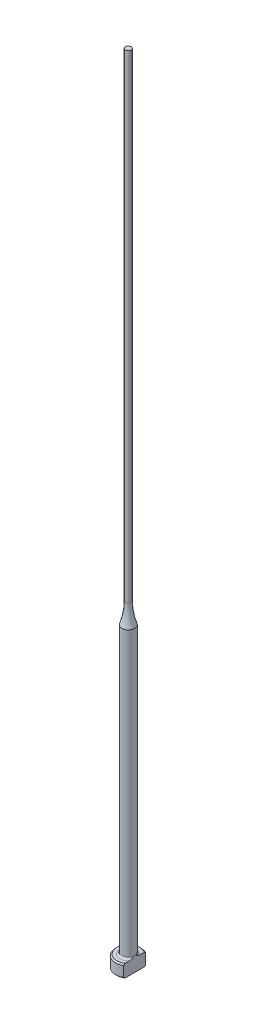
ISO-10303-21;
HEADER;
FILE_DESCRIPTION(('STEP AP214'),'2;1');
FILE_NAME('part.step','',(''),(''),'','','');
FILE_SCHEMA(('AUTOMOTIVE_DESIGN { 1 0 10303 214 1 1 1 1 }'));
ENDSEC;
DATA;
#1=APPLICATION_CONTEXT('core data for automotive mechanical design processes');
#2=APPLICATION_PROTOCOL_DEFINITION('international standard','automotive_design',2000,#1);
#3=PRODUCT_CONTEXT('',#1,'mechanical');
#4=PRODUCT('Part','Part','',(#3));
#5=PRODUCT_RELATED_PRODUCT_CATEGORY('part','',(#4));
#6=PRODUCT_DEFINITION_FORMATION('','',#4);
#7=PRODUCT_DEFINITION_CONTEXT('part definition',#1,'design');
#8=PRODUCT_DEFINITION('design','',#6,#7);
#9=PRODUCT_DEFINITION_SHAPE('','',#8);
#10=(LENGTH_UNIT() NAMED_UNIT(*) SI_UNIT(.MILLI.,.METRE.));
#11=(NAMED_UNIT(*) PLANE_ANGLE_UNIT() SI_UNIT($,.RADIAN.));
#12=(NAMED_UNIT(*) SI_UNIT($,.STERADIAN.) SOLID_ANGLE_UNIT());
#13=UNCERTAINTY_MEASURE_WITH_UNIT(LENGTH_MEASURE(1.E-05),#10,'distance_accuracy_value','');
#14=(GEOMETRIC_REPRESENTATION_CONTEXT(3) GLOBAL_UNCERTAINTY_ASSIGNED_CONTEXT((#13)) GLOBAL_UNIT_ASSIGNED_CONTEXT((#10,
#11,#12)) REPRESENTATION_CONTEXT('',''));
#15=CARTESIAN_POINT('',(0.,0.,0.));
#16=DIRECTION('',(0.,0.,1.));
#17=DIRECTION('',(1.,0.,0.));
#18=AXIS2_PLACEMENT_3D('',#15,#16,#17);
#19=CARTESIAN_POINT('',(-1.99999999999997,2.,0.));
#20=DIRECTION('',(0.,1.,0.));
#21=DIRECTION('',(0.,0.,1.));
#22=AXIS2_PLACEMENT_3D('',#19,#20,#21);
#23=PLANE('',#22);
#24=CARTESIAN_POINT('',(0.,2.,0.));
#25=DIRECTION('',(0.,1.,0.));
#26=DIRECTION('',(0.,0.,1.));
#27=AXIS2_PLACEMENT_3D('',#24,#25,#26);
#28=CIRCLE('',#27,1.79999999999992);
#29=CARTESIAN_POINT('',(0.999999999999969,2.,-1.4966629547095));
#30=VERTEX_POINT('',#29);
#31=CARTESIAN_POINT('',(0.999999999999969,2.,1.4966629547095));
#32=VERTEX_POINT('',#31);
#33=EDGE_CURVE('E187',#30,#32,#28,.T.);
#34=ORIENTED_EDGE('',*,*,#33,.T.);
#35=DIRECTION('',(0.,0.,-1.));
#36=VECTOR('',#35,1.);
#37=CARTESIAN_POINT('',(0.999999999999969,2.,0.));
#38=LINE('',#37,#36);
#39=CARTESIAN_POINT('',(0.999999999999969,2.00000000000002,0.830662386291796));
#40=VERTEX_POINT('',#39);
#41=EDGE_CURVE('E57',#32,#40,#38,.T.);
#42=ORIENTED_EDGE('',*,*,#41,.T.);
#43=CARTESIAN_POINT('',(0.,2.,0.));
#44=DIRECTION('',(0.,1.,0.));
#45=DIRECTION('',(0.,0.,1.));
#46=AXIS2_PLACEMENT_3D('',#43,#44,#45);
#47=CIRCLE('',#46,1.29999999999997);
#48=CARTESIAN_POINT('',(0.999999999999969,2.00000000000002,-0.830662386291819));
#49=VERTEX_POINT('',#48);
#50=EDGE_CURVE('E108',#40,#49,#47,.F.);
#51=ORIENTED_EDGE('',*,*,#50,.T.);
#52=EDGE_CURVE('E137',#49,#30,#38,.T.);
#53=ORIENTED_EDGE('',*,*,#52,.T.);
#54=EDGE_LOOP('',(#34,#42,#51,#53));
#55=FACE_BOUND('',#54,.T.);
#56=ADVANCED_FACE('F32',(#55),#23,.T.);
#57=CARTESIAN_POINT('',(0.,259.958771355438,0.));
#58=DIRECTION('',(0.,1.,0.));
#59=DIRECTION('',(0.,0.,1.));
#60=AXIS2_PLACEMENT_3D('',#57,#58,#59);
#61=CYLINDRICAL_SURFACE('',#60,1.99999999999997);
#62=CARTESIAN_POINT('',(0.,1.79999999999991,0.));
#63=DIRECTION('',(0.,1.,0.));
#64=DIRECTION('',(0.,0.,1.));
#65=AXIS2_PLACEMENT_3D('',#62,#63,#64);
#66=CIRCLE('',#65,1.99999999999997);
#67=CARTESIAN_POINT('',(0.999999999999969,1.79999999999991,1.73205080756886));
#68=VERTEX_POINT('',#67);
#69=CARTESIAN_POINT('',(0.999999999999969,1.79999999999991,-1.73205080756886));
#70=VERTEX_POINT('',#69);
#71=EDGE_CURVE('E105',#68,#70,#66,.F.);
#72=ORIENTED_EDGE('',*,*,#71,.T.);
#73=DIRECTION('',(0.,-1.,0.));
#74=VECTOR('',#73,1.);
#75=CARTESIAN_POINT('',(0.999999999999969,125.,-1.73205080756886));
#76=LINE('',#75,#74);
#77=CARTESIAN_POINT('',(0.999999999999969,0.199999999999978,-1.73205080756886));
#78=VERTEX_POINT('',#77);
#79=EDGE_CURVE('E193',#70,#78,#76,.T.);
#80=ORIENTED_EDGE('',*,*,#79,.T.);
#81=CARTESIAN_POINT('',(0.,0.199999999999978,0.));
#82=DIRECTION('',(0.,-1.,0.));
#83=DIRECTION('',(0.,0.,-1.));
#84=AXIS2_PLACEMENT_3D('',#81,#82,#83);
#85=CIRCLE('',#84,1.99999999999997);
#86=CARTESIAN_POINT('',(0.999999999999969,0.199999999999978,1.73205080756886));
#87=VERTEX_POINT('',#86);
#88=EDGE_CURVE('E100',#78,#87,#85,.F.);
#89=ORIENTED_EDGE('',*,*,#88,.T.);
#90=DIRECTION('',(0.,-1.,0.));
#91=VECTOR('',#90,1.);
#92=CARTESIAN_POINT('',(0.999999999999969,125.,1.73205080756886));
#93=LINE('',#92,#91);
#94=EDGE_CURVE('E93',#68,#87,#93,.T.);
#95=ORIENTED_EDGE('',*,*,#94,.F.);
#96=EDGE_LOOP('',(#72,#80,#89,#95));
#97=FACE_BOUND('',#96,.T.);
#98=ADVANCED_FACE('F158',(#97),#61,.T.);
#99=CARTESIAN_POINT('',(0.,0.,0.));
#100=DIRECTION('',(0.,-1.,0.));
#101=DIRECTION('',(0.,0.,-1.));
#102=AXIS2_PLACEMENT_3D('',#99,#100,#101);
#103=PLANE('',#102);
#104=CARTESIAN_POINT('',(0.,0.,0.));
#105=DIRECTION('',(0.,-1.,0.));
#106=DIRECTION('',(0.,0.,-1.));
#107=AXIS2_PLACEMENT_3D('',#104,#105,#106);
#108=CIRCLE('',#107,1.8);
#109=CARTESIAN_POINT('',(0.999999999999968,0.,1.49666295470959));
#110=VERTEX_POINT('',#109);
#111=CARTESIAN_POINT('',(0.999999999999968,0.,-1.49666295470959));
#112=VERTEX_POINT('',#111);
#113=EDGE_CURVE('E98',#110,#112,#108,.T.);
#114=ORIENTED_EDGE('',*,*,#113,.T.);
#115=DIRECTION('',(0.,0.,1.));
#116=VECTOR('',#115,1.);
#117=CARTESIAN_POINT('',(0.999999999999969,0.,-1.73205080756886));
#118=LINE('',#117,#116);
#119=EDGE_CURVE('E83',#112,#110,#118,.T.);
#120=ORIENTED_EDGE('',*,*,#119,.T.);
#121=EDGE_LOOP('',(#114,#120));
#122=FACE_BOUND('',#121,.T.);
#123=ADVANCED_FACE('F103',(#122),#103,.T.);
#124=CARTESIAN_POINT('',(0.,2.,0.));
#125=DIRECTION('',(0.,-1.,0.));
#126=DIRECTION('',(0.,0.,-1.));
#127=AXIS2_PLACEMENT_3D('',#124,#125,#126);
#128=CONICAL_SURFACE('',#127,1.79999999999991,0.785398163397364);
#129=ORIENTED_EDGE('',*,*,#71,.F.);
#130=CARTESIAN_POINT('',(0.999999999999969,-0.143084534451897,3.81417299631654));
#131=CARTESIAN_POINT('',(0.999999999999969,-0.0593997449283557,3.72765647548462));
#132=CARTESIAN_POINT('',(0.999999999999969,0.0241940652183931,3.64105173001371));
#133=CARTESIAN_POINT('',(0.999999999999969,0.19114891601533,3.46761616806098));
#134=CARTESIAN_POINT('',(0.999999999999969,0.27450995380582,3.38078534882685));
#135=CARTESIAN_POINT('',(0.999999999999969,0.52424932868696,3.11979400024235));
#136=CARTESIAN_POINT('',(0.999999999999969,0.690198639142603,2.94522254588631));
#137=CARTESIAN_POINT('',(0.999999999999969,1.0169755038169,2.59782670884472));
#138=CARTESIAN_POINT('',(0.999999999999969,1.1778392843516,2.42503661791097));
#139=CARTESIAN_POINT('',(0.999999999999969,1.41669118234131,2.16364984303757));
#140=CARTESIAN_POINT('',(0.999999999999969,1.49589273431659,2.07616357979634));
#141=CARTESIAN_POINT('',(0.999999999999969,1.653138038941,1.90015721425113));
#142=CARTESIAN_POINT('',(0.999999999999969,1.73118183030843,1.81163714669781));
#143=CARTESIAN_POINT('',(0.999999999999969,1.85567318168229,1.66767927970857));
#144=CARTESIAN_POINT('',(0.999999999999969,1.90265415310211,1.61270332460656));
#145=CARTESIAN_POINT('',(0.999999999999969,1.99577882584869,1.50203557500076));
#146=CARTESIAN_POINT('',(0.999999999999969,2.04192244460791,1.44634371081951));
#147=CARTESIAN_POINT('',(0.999999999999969,2.13356596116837,1.33345480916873));
#148=CARTESIAN_POINT('',(0.999999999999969,2.17905399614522,1.27624810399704));
#149=CARTESIAN_POINT('',(0.999999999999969,2.26844283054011,1.1606097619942));
#150=CARTESIAN_POINT('',(0.999999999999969,2.31234379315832,1.1021782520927));
#151=CARTESIAN_POINT('',(0.999999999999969,2.39853453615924,0.982773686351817));
#152=CARTESIAN_POINT('',(0.999999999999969,2.44078986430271,0.92177554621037));
#153=CARTESIAN_POINT('',(0.999999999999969,2.5218781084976,0.79738711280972));
#154=CARTESIAN_POINT('',(0.999999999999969,2.56070631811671,0.733993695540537));
#155=CARTESIAN_POINT('',(0.999999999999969,2.63248592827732,0.604932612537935));
#156=CARTESIAN_POINT('',(0.999999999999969,2.66550424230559,0.539302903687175));
#157=CARTESIAN_POINT('',(0.999999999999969,2.72301550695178,0.404437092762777));
#158=CARTESIAN_POINT('',(0.999999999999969,2.74753707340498,0.335214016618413));
#159=CARTESIAN_POINT('',(0.999999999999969,2.77407110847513,0.231400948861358));
#160=CARTESIAN_POINT('',(0.999999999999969,2.78110742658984,0.198093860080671));
#161=CARTESIAN_POINT('',(0.999999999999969,2.79200506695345,0.130954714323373));
#162=CARTESIAN_POINT('',(0.999999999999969,2.79586666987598,0.0971227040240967));
#163=CARTESIAN_POINT('',(0.999999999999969,2.80013905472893,0.0293410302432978));
#164=CARTESIAN_POINT('',(0.999999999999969,2.80056046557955,-0.00460794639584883));
#165=CARTESIAN_POINT('',(0.999999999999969,2.79795882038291,-0.0723663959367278));
#166=CARTESIAN_POINT('',(0.999999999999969,2.79493547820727,-0.106175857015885));
#167=CARTESIAN_POINT('',(0.999999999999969,2.78105481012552,-0.206326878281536));
#168=CARTESIAN_POINT('',(0.999999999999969,2.76542146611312,-0.272037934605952));
#169=CARTESIAN_POINT('',(0.999999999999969,2.73477554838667,-0.368312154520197));
#170=CARTESIAN_POINT('',(0.999999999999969,2.72331063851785,-0.400123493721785));
#171=CARTESIAN_POINT('',(0.999999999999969,2.69840546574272,-0.462964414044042));
#172=CARTESIAN_POINT('',(0.999999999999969,2.68496560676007,-0.493994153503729));
#173=CARTESIAN_POINT('',(0.999999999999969,2.64209309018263,-0.586298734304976));
#174=CARTESIAN_POINT('',(0.999999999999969,2.61022871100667,-0.64643570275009));
#175=CARTESIAN_POINT('',(0.999999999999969,2.54228534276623,-0.76430433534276));
#176=CARTESIAN_POINT('',(0.999999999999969,2.50620119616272,-0.822032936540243));
#177=CARTESIAN_POINT('',(0.999999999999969,2.43107084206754,-0.935840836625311));
#178=CARTESIAN_POINT('',(0.999999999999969,2.39201347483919,-0.991912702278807));
#179=CARTESIAN_POINT('',(0.999999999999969,2.31195870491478,-1.10259849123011));
#180=CARTESIAN_POINT('',(0.999999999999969,2.27096226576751,-1.15721311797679));
#181=CARTESIAN_POINT('',(0.999999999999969,2.18701695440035,-1.26606869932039));
#182=CARTESIAN_POINT('',(0.999999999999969,2.14404946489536,-1.32029522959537));
#183=CARTESIAN_POINT('',(0.999999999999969,2.05705050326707,-1.42788988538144));
#184=CARTESIAN_POINT('',(0.999999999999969,2.01301896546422,-1.48125795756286));
#185=CARTESIAN_POINT('',(0.999999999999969,1.8799506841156,-1.64010952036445));
#186=CARTESIAN_POINT('',(0.999999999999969,1.78973357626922,-1.74460261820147));
#187=CARTESIAN_POINT('',(0.999999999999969,1.62290341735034,-1.9342683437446));
#188=CARTESIAN_POINT('',(0.999999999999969,1.54658658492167,-2.01970404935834));
#189=CARTESIAN_POINT('',(0.999999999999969,1.39301250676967,-2.18973019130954));
#190=CARTESIAN_POINT('',(0.999999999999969,1.31575523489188,-2.27432060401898));
#191=CARTESIAN_POINT('',(0.999999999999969,1.08283440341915,-2.52732479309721));
#192=CARTESIAN_POINT('',(0.999999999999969,0.926165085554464,-2.69481086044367));
#193=CARTESIAN_POINT('',(0.999999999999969,0.617772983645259,-3.0214725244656));
#194=CARTESIAN_POINT('',(0.999999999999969,0.466111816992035,-3.18070657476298));
#195=CARTESIAN_POINT('',(0.999999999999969,0.238015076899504,-3.41880818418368));
#196=CARTESIAN_POINT('',(0.999999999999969,0.161924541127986,-3.49800657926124));
#197=CARTESIAN_POINT('',(0.999999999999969,0.00955322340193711,-3.65621892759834));
#198=CARTESIAN_POINT('',(0.999999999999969,-0.0667275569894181,-3.73523288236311));
#199=CARTESIAN_POINT('',(0.999999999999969,-0.143084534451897,-3.81417299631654));
#200=B_SPLINE_CURVE_WITH_KNOTS('',3,(#130,#131,#132,#133,#134,#135,#136,#137,#138,#139,#140,
#141,#142,#143,#144,#145,#146,#147,#148,#149,#150,#151,#152,#153,#154,#155,#156,#157,#158,#159,
#160,#161,#162,#163,#164,#165,#166,#167,#168,#169,#170,#171,#172,#173,#174,#175,#176,#177,#178,
#179,#180,#181,#182,#183,#184,#185,#186,#187,#188,#189,#190,#191,#192,#193,#194,#195,#196,#197,
#198,#199),.UNSPECIFIED.,.F.,.F.,(4,2,2,2,2,2,2,2,2,2,2,2,2,2,2,2,2,2,2,2,2,2,2,2,2,2,2,2,2,2,2,
2,2,2,4),(0.,0.361101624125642,0.722207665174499,1.44478731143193,2.15299784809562,
2.50702638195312,2.86104304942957,3.07798416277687,3.29494655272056,3.51418925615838,
3.73340935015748,3.95594813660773,4.17878792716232,4.3988639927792,4.6181915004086,
4.72018864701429,4.82217677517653,4.92384967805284,5.02553102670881,5.22698459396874,
5.32838854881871,5.4297717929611,5.63365200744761,5.83778406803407,6.04272417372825,
6.24756349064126,6.4551039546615,6.66265726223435,7.07676259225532,7.42043039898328,
7.76410778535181,8.45210822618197,9.11180822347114,9.44129145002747,9.77077197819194),.UNSPECIFIED.);
#201=EDGE_CURVE('E136',#68,#32,#200,.T.);
#202=ORIENTED_EDGE('',*,*,#201,.T.);
#203=ORIENTED_EDGE('',*,*,#33,.F.);
#204=EDGE_CURVE('E128',#30,#70,#200,.T.);
#205=ORIENTED_EDGE('',*,*,#204,.T.);
#206=EDGE_LOOP('',(#129,#202,#203,#205));
#207=FACE_BOUND('',#206,.T.);
#208=ADVANCED_FACE('F144',(#207),#128,.T.);
#209=CARTESIAN_POINT('',(0.,0.199999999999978,0.));
#210=DIRECTION('',(0.,1.,0.));
#211=DIRECTION('',(0.,0.,1.));
#212=AXIS2_PLACEMENT_3D('',#209,#210,#211);
#213=CONICAL_SURFACE('',#212,1.99999999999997,0.785398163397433);
#214=ORIENTED_EDGE('',*,*,#88,.F.);
#215=CARTESIAN_POINT('',(0.999999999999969,2.14308453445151,-3.81417299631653));
#216=CARTESIAN_POINT('',(0.999999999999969,2.05939974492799,-3.72765647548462));
#217=CARTESIAN_POINT('',(0.999999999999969,1.97580593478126,-3.64105173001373));
#218=CARTESIAN_POINT('',(0.999999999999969,1.80885108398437,-3.46761616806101));
#219=CARTESIAN_POINT('',(0.999999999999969,1.7254900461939,-3.38078534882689));
#220=CARTESIAN_POINT('',(0.999999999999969,1.47575067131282,-3.11979400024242));
#221=CARTESIAN_POINT('',(0.999999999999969,1.30980136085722,-2.94522254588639));
#222=CARTESIAN_POINT('',(0.999999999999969,0.983024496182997,-2.59782670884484));
#223=CARTESIAN_POINT('',(0.999999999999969,0.822160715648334,-2.42503661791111));
#224=CARTESIAN_POINT('',(0.999999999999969,0.583308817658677,-2.16364984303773));
#225=CARTESIAN_POINT('',(0.999999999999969,0.504107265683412,-2.07616357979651));
#226=CARTESIAN_POINT('',(0.999999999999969,0.34686196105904,-1.90015721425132));
#227=CARTESIAN_POINT('',(0.999999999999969,0.268818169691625,-1.81163714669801));
#228=CARTESIAN_POINT('',(0.999999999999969,0.144326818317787,-1.66767927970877));
#229=CARTESIAN_POINT('',(0.999999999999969,0.097345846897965,-1.61270332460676));
#230=CARTESIAN_POINT('',(0.999999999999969,0.00422117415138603,-1.50203557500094));
#231=CARTESIAN_POINT('',(0.999999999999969,-0.0419224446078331,-1.44634371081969));
#232=CARTESIAN_POINT('',(0.999999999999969,-0.133565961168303,-1.33345480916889));
#233=CARTESIAN_POINT('',(0.999999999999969,-0.179053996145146,-1.2762481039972));
#234=CARTESIAN_POINT('',(0.999999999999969,-0.268442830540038,-1.16060976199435));
#235=CARTESIAN_POINT('',(0.999999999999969,-0.312343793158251,-1.10217825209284));
#236=CARTESIAN_POINT('',(0.999999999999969,-0.398534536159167,-0.982773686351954));
#237=CARTESIAN_POINT('',(0.999999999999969,-0.440789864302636,-0.921775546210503));
#238=CARTESIAN_POINT('',(0.999999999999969,-0.521878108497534,-0.797387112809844));
#239=CARTESIAN_POINT('',(0.999999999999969,-0.560706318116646,-0.733993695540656));
#240=CARTESIAN_POINT('',(0.999999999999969,-0.632485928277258,-0.604932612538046));
#241=CARTESIAN_POINT('',(0.999999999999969,-0.665504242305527,-0.539302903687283));
#242=CARTESIAN_POINT('',(0.999999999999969,-0.723015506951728,-0.404437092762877));
#243=CARTESIAN_POINT('',(0.999999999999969,-0.747537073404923,-0.335214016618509));
#244=CARTESIAN_POINT('',(0.999999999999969,-0.774071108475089,-0.231400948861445));
#245=CARTESIAN_POINT('',(0.999999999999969,-0.781107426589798,-0.198093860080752));
#246=CARTESIAN_POINT('',(0.999999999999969,-0.792005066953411,-0.130954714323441));
#247=CARTESIAN_POINT('',(0.999999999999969,-0.795866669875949,-0.097122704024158));
#248=CARTESIAN_POINT('',(0.999999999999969,-0.800139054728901,-0.0293410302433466));
#249=CARTESIAN_POINT('',(0.999999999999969,-0.800560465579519,0.00460794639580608));
#250=CARTESIAN_POINT('',(0.999999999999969,-0.797958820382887,0.0723663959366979));
#251=CARTESIAN_POINT('',(0.999999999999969,-0.794935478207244,0.106175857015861));
#252=CARTESIAN_POINT('',(0.999999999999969,-0.78105481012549,0.206326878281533));
#253=CARTESIAN_POINT('',(0.999999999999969,-0.765421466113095,0.272037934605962));
#254=CARTESIAN_POINT('',(0.999999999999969,-0.734775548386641,0.368312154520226));
#255=CARTESIAN_POINT('',(0.999999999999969,-0.723310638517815,0.40012349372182));
#256=CARTESIAN_POINT('',(0.999999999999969,-0.698405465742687,0.46296441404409));
#257=CARTESIAN_POINT('',(0.999999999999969,-0.684965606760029,0.493994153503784));
#258=CARTESIAN_POINT('',(0.999999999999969,-0.642093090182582,0.586298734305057));
#259=CARTESIAN_POINT('',(0.999999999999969,-0.610228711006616,0.64643570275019));
#260=CARTESIAN_POINT('',(0.999999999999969,-0.542285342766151,0.764304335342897));
#261=CARTESIAN_POINT('',(0.999999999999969,-0.506201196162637,0.822032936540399));
#262=CARTESIAN_POINT('',(0.999999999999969,-0.431070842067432,0.935840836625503));
#263=CARTESIAN_POINT('',(0.999999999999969,-0.392013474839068,0.991912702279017));
#264=CARTESIAN_POINT('',(0.999999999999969,-0.311958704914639,1.10259849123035));
#265=CARTESIAN_POINT('',(0.999999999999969,-0.27096226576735,1.15721311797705));
#266=CARTESIAN_POINT('',(0.999999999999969,-0.187016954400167,1.26606869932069));
#267=CARTESIAN_POINT('',(0.999999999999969,-0.144049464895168,1.32029522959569));
#268=CARTESIAN_POINT('',(0.999999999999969,-0.0570505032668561,1.4278898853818));
#269=CARTESIAN_POINT('',(0.999999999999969,-0.0130189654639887,1.48125795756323));
#270=CARTESIAN_POINT('',(0.999999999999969,0.120049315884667,1.64010952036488));
#271=CARTESIAN_POINT('',(0.999999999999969,0.21026642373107,1.74460261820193));
#272=CARTESIAN_POINT('',(0.999999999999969,0.377096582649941,1.93426834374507));
#273=CARTESIAN_POINT('',(0.999999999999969,0.453413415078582,2.01970404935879));
#274=CARTESIAN_POINT('',(0.999999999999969,0.606987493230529,2.18973019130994));
#275=CARTESIAN_POINT('',(0.999999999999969,0.684244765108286,2.27432060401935));
#276=CARTESIAN_POINT('',(0.999999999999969,0.917165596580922,2.52732479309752));
#277=CARTESIAN_POINT('',(0.999999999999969,1.07383491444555,2.69481086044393));
#278=CARTESIAN_POINT('',(0.999999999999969,1.38222701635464,3.02147252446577));
#279=CARTESIAN_POINT('',(0.999999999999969,1.53388818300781,3.18070657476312));
#280=CARTESIAN_POINT('',(0.999999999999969,1.76198492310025,3.41880818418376));
#281=CARTESIAN_POINT('',(0.999999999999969,1.83807545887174,3.49800657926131));
#282=CARTESIAN_POINT('',(0.999999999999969,1.99044677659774,3.65621892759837));
#283=CARTESIAN_POINT('',(0.999999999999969,2.06672755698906,3.73523288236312));
#284=CARTESIAN_POINT('',(0.999999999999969,2.14308453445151,3.81417299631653));
#285=B_SPLINE_CURVE_WITH_KNOTS('',3,(#215,#216,#217,#218,#219,#220,#221,#222,#223,#224,#225,
#226,#227,#228,#229,#230,#231,#232,#233,#234,#235,#236,#237,#238,#239,#240,#241,#242,#243,#244,
#245,#246,#247,#248,#249,#250,#251,#252,#253,#254,#255,#256,#257,#258,#259,#260,#261,#262,#263,
#264,#265,#266,#267,#268,#269,#270,#271,#272,#273,#274,#275,#276,#277,#278,#279,#280,#281,#282,
#283,#284),.UNSPECIFIED.,.F.,.F.,(4,2,2,2,2,2,2,2,2,2,2,2,2,2,2,2,2,2,2,2,2,2,2,2,2,2,2,2,2,2,2,
2,2,2,4),(0.,0.36110162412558,0.722207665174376,1.44478731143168,2.15299784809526,
2.5070263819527,2.8610430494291,3.07798416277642,3.29494655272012,3.51418925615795,
3.73340935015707,3.95594813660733,4.17878792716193,4.39886399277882,4.61819150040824,
4.72018864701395,4.82217677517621,4.92384967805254,5.02553102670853,5.22698459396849,
5.32838854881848,5.42977179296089,5.63365200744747,5.83778406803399,6.04272417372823,
6.24756349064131,6.45510395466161,6.66265726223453,7.07676259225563,7.42043039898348,
7.7641077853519,8.45210822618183,9.1118082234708,9.44129145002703,9.77077197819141),.UNSPECIFIED.);
#286=EDGE_CURVE('E86',#78,#112,#285,.T.);
#287=ORIENTED_EDGE('',*,*,#286,.T.);
#288=ORIENTED_EDGE('',*,*,#113,.F.);
#289=EDGE_CURVE('E89',#110,#87,#285,.T.);
#290=ORIENTED_EDGE('',*,*,#289,.T.);
#291=EDGE_LOOP('',(#214,#287,#288,#290));
#292=FACE_BOUND('',#291,.T.);
#293=ADVANCED_FACE('F97',(#292),#213,.T.);
#294=CARTESIAN_POINT('',(0.,2.30000000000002,0.));
#295=DIRECTION('',(0.,1.,0.));
#296=DIRECTION('',(0.,0.,1.));
#297=AXIS2_PLACEMENT_3D('',#294,#295,#296);
#298=TOROIDAL_SURFACE('',#297,1.29999999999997,0.3);
#299=CARTESIAN_POINT('',(0.999999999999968,2.30000000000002,0.));
#300=CARTESIAN_POINT('',(0.999999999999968,2.30000064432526,8.6574445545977E-12));
#301=CARTESIAN_POINT('',(0.999999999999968,2.30000128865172,-9.05742231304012E-08));
#302=CARTESIAN_POINT('',(0.999999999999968,2.30000254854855,-3.98319620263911E-07));
#303=CARTESIAN_POINT('',(0.999999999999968,2.30000316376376,-6.16748313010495E-07));
#304=CARTESIAN_POINT('',(0.999999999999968,2.30000438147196,-1.15047367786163E-06));
#305=CARTESIAN_POINT('',(0.999999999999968,2.30000498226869,-1.46954564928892E-06));
#306=CARTESIAN_POINT('',(0.999999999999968,2.30000613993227,-2.17388585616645E-06));
#307=CARTESIAN_POINT('',(0.999999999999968,2.3000066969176,-2.55896592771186E-06));
#308=CARTESIAN_POINT('',(0.999999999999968,2.30000847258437,-3.89137454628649E-06));
#309=CARTESIAN_POINT('',(0.999999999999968,2.30000962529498,-4.9272569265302E-06));
#310=CARTESIAN_POINT('',(0.999999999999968,2.30001175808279,-7.12255376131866E-06));
#311=CARTESIAN_POINT('',(0.999999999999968,2.30001274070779,-8.27963246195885E-06));
#312=CARTESIAN_POINT('',(0.999999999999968,2.30001619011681,-1.25710396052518E-05));
#313=CARTESIAN_POINT('',(0.999999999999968,2.30001847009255,-1.58589994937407E-05));
#314=CARTESIAN_POINT('',(0.999999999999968,2.3000224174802,-2.25210462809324E-05));
#315=CARTESIAN_POINT('',(0.999999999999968,2.30002411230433,-2.58796667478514E-05));
#316=CARTESIAN_POINT('',(0.999999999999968,2.30003085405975,-3.94941957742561E-05));
#317=CARTESIAN_POINT('',(0.999999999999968,2.30003568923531,-4.98493079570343E-05));
#318=CARTESIAN_POINT('',(0.999999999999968,2.30004388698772,-6.96407730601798E-05));
#319=CARTESIAN_POINT('',(0.999999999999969,2.30004735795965,-7.903098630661E-05));
#320=CARTESIAN_POINT('',(0.999999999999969,2.30007348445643,-0.000144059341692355));
#321=CARTESIAN_POINT('',(0.999999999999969,2.30010510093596,-0.000195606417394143));
#322=CARTESIAN_POINT('',(0.999999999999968,2.30022061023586,-0.000391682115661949));
#323=CARTESIAN_POINT('',(0.999999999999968,2.3002978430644,-0.000539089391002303));
#324=CARTESIAN_POINT('',(0.999999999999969,2.30059433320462,-0.00109591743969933));
#325=CARTESIAN_POINT('',(0.999999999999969,2.30082052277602,-0.00150237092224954));
#326=CARTESIAN_POINT('',(0.999999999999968,2.30171558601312,-0.00311941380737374));
#327=CARTESIAN_POINT('',(0.999999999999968,2.30237677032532,-0.00433326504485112));
#328=CARTESIAN_POINT('',(0.999999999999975,2.31602135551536,-0.0293725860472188));
#329=CARTESIAN_POINT('',(0.99999999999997,2.32909104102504,-0.0531623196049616));
#330=CARTESIAN_POINT('',(0.999999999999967,2.35458080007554,-0.100088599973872));
#331=CARTESIAN_POINT('',(0.999999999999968,2.36700820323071,-0.123221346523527));
#332=CARTESIAN_POINT('',(0.999999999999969,2.39281545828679,-0.172044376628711));
#333=CARTESIAN_POINT('',(0.999999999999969,2.4061616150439,-0.197752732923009));
#334=CARTESIAN_POINT('',(0.999999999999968,2.4323541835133,-0.249714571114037));
#335=CARTESIAN_POINT('',(0.999999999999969,2.44519503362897,-0.27597087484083));
#336=CARTESIAN_POINT('',(0.999999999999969,2.46718175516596,-0.322864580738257));
#337=CARTESIAN_POINT('',(0.999999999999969,2.47650292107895,-0.34341923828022));
#338=CARTESIAN_POINT('',(0.999999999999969,2.49448113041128,-0.384761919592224));
#339=CARTESIAN_POINT('',(0.999999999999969,2.50313958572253,-0.405549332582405));
#340=CARTESIAN_POINT('',(0.999999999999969,2.5276434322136,-0.467585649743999));
#341=CARTESIAN_POINT('',(0.999999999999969,2.54239224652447,-0.509286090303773));
#342=CARTESIAN_POINT('',(0.999999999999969,2.56458900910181,-0.58349816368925));
#343=CARTESIAN_POINT('',(0.999999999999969,2.57294045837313,-0.61573699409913));
#344=CARTESIAN_POINT('',(0.999999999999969,2.58691787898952,-0.682155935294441));
#345=CARTESIAN_POINT('',(0.999999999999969,2.5924232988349,-0.716362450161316));
#346=CARTESIAN_POINT('',(0.999999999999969,2.59932200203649,-0.784996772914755));
#347=CARTESIAN_POINT('',(0.999999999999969,2.60074119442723,-0.819421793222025));
#348=CARTESIAN_POINT('',(0.999999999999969,2.59853032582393,-0.88779225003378));
#349=CARTESIAN_POINT('',(0.999999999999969,2.59495737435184,-0.921738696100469));
#350=CARTESIAN_POINT('',(0.999999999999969,2.58381038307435,-0.977927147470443));
#351=CARTESIAN_POINT('',(0.999999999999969,2.57785171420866,-1.00048693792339));
#352=CARTESIAN_POINT('',(0.999999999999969,2.56267132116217,-1.0445512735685));
#353=CARTESIAN_POINT('',(0.999999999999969,2.55344592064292,-1.06605459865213));
#354=CARTESIAN_POINT('',(0.999999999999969,2.53348156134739,-1.10327564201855));
#355=CARTESIAN_POINT('',(0.999999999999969,2.52335553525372,-1.11931996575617));
#356=CARTESIAN_POINT('',(0.999999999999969,2.50063930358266,-1.1495565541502));
#357=CARTESIAN_POINT('',(0.999999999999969,2.48805327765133,-1.16375189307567));
#358=CARTESIAN_POINT('',(0.999999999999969,2.46313284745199,-1.18709127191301));
#359=CARTESIAN_POINT('',(0.999999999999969,2.45121755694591,-1.19668155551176));
#360=CARTESIAN_POINT('',(0.999999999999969,2.4259612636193,-1.21377371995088));
#361=CARTESIAN_POINT('',(0.999999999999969,2.41262072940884,-1.2212762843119));
#362=CARTESIAN_POINT('',(0.999999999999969,2.38471163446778,-1.23381879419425));
#363=CARTESIAN_POINT('',(0.999999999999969,2.3701356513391,-1.23884240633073));
#364=CARTESIAN_POINT('',(0.999999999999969,2.34029120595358,-1.2460136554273));
#365=CARTESIAN_POINT('',(0.999999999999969,2.32502317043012,-1.24816304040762));
#366=CARTESIAN_POINT('',(0.999999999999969,2.29609418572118,-1.24936303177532));
#367=CARTESIAN_POINT('',(0.999999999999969,2.28244572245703,-1.24873511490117));
#368=CARTESIAN_POINT('',(0.999999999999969,2.25546467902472,-1.24513625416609));
#369=CARTESIAN_POINT('',(0.999999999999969,2.2421320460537,-1.24216570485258));
#370=CARTESIAN_POINT('',(0.999999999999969,2.21644742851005,-1.23414136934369));
#371=CARTESIAN_POINT('',(0.999999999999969,2.20408009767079,-1.22913614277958));
#372=CARTESIAN_POINT('',(0.999999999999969,2.18026539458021,-1.2172891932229));
#373=CARTESIAN_POINT('',(0.999999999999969,2.16881815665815,-1.21044720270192));
#374=CARTESIAN_POINT('',(0.999999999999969,2.14602713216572,-1.19450929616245));
#375=CARTESIAN_POINT('',(0.999999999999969,2.1347876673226,-1.18526487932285));
#376=CARTESIAN_POINT('',(0.999999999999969,2.11372805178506,-1.16528066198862));
#377=CARTESIAN_POINT('',(0.999999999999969,2.1039092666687,-1.15453944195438));
#378=CARTESIAN_POINT('',(0.999999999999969,2.08131380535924,-1.12639326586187));
#379=CARTESIAN_POINT('',(0.999999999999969,2.06941227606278,-1.10828305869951));
#380=CARTESIAN_POINT('',(0.999999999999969,2.04871157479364,-1.07041295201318));
#381=CARTESIAN_POINT('',(0.999999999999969,2.03991325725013,-1.05065259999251));
#382=CARTESIAN_POINT('',(0.999999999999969,2.02219264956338,-1.00203188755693));
#383=CARTESIAN_POINT('',(0.999999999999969,2.01461756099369,-0.972682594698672));
#384=CARTESIAN_POINT('',(0.999999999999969,2.00410660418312,-0.912914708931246));
#385=CARTESIAN_POINT('',(0.999999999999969,2.00122174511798,-0.882487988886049));
#386=CARTESIAN_POINT('',(0.999999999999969,1.99886242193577,-0.80318909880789));
#387=CARTESIAN_POINT('',(0.999999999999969,2.0024814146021,-0.754226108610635));
#388=CARTESIAN_POINT('',(0.999999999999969,2.01327071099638,-0.682724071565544));
#389=CARTESIAN_POINT('',(0.999999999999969,2.01762186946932,-0.659663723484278));
#390=CARTESIAN_POINT('',(0.999999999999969,2.02775671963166,-0.613959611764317));
#391=CARTESIAN_POINT('',(0.999999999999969,2.03353398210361,-0.59131445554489));
#392=CARTESIAN_POINT('',(0.999999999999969,2.05232003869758,-0.525222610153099));
#393=CARTESIAN_POINT('',(0.999999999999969,2.0670175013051,-0.482256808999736));
#394=CARTESIAN_POINT('',(0.999999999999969,2.09166172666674,-0.418361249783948));
#395=CARTESIAN_POINT('',(0.999999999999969,2.10040936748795,-0.396945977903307));
#396=CARTESIAN_POINT('',(0.999999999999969,2.11862724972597,-0.354367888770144));
#397=CARTESIAN_POINT('',(0.999999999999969,2.12809902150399,-0.33320572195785));
#398=CARTESIAN_POINT('',(0.999999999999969,2.15054796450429,-0.284809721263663));
#399=CARTESIAN_POINT('',(0.999999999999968,2.16372144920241,-0.257667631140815));
#400=CARTESIAN_POINT('',(0.999999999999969,2.19063957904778,-0.203972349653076));
#401=CARTESIAN_POINT('',(0.999999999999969,2.20437810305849,-0.177416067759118));
#402=CARTESIAN_POINT('',(0.999999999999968,2.23096755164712,-0.127000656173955));
#403=CARTESIAN_POINT('',(0.999999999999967,2.2437812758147,-0.103121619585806));
#404=CARTESIAN_POINT('',(0.99999999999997,2.27007504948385,-0.0546869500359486));
#405=CARTESIAN_POINT('',(0.999999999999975,2.28356304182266,-0.0301354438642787));
#406=CARTESIAN_POINT('',(0.999999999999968,2.29762327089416,-0.00433318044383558));
#407=CARTESIAN_POINT('',(0.999999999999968,2.29828450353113,-0.00311924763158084));
#408=CARTESIAN_POINT('',(0.999999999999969,2.29917957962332,-0.0015021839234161));
#409=CARTESIAN_POINT('',(0.999999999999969,2.2994057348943,-0.0010957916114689));
#410=CARTESIAN_POINT('',(0.999999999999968,2.29970218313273,-0.000539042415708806));
#411=CARTESIAN_POINT('',(0.999999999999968,2.29977940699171,-0.000391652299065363));
#412=CARTESIAN_POINT('',(0.999999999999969,2.29989490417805,-0.000195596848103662));
#413=CARTESIAN_POINT('',(0.999999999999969,2.2999265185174,-0.000144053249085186));
#414=CARTESIAN_POINT('',(0.999999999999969,2.29995264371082,-7.90290824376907E-05));
#415=CARTESIAN_POINT('',(0.999999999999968,2.29995611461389,-6.96391975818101E-05));
#416=CARTESIAN_POINT('',(0.999999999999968,2.29996431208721,-4.98484228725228E-05));
#417=CARTESIAN_POINT('',(0.999999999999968,2.29996914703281,-3.94936645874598E-05));
#418=CARTESIAN_POINT('',(0.999999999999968,2.29997588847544,-2.587953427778E-05));
#419=CARTESIAN_POINT('',(0.999999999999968,2.29997758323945,-2.25209724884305E-05));
#420=CARTESIAN_POINT('',(0.999999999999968,2.29998153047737,-1.58590310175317E-05));
#421=CARTESIAN_POINT('',(0.999999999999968,2.29998381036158,-1.25711163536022E-05));
#422=CARTESIAN_POINT('',(0.999999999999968,2.29998725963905,-8.27974911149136E-06));
#423=CARTESIAN_POINT('',(0.999999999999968,2.29998824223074,-7.122675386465E-06));
#424=CARTESIAN_POINT('',(0.999999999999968,2.29999037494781,-4.92738159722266E-06));
#425=CARTESIAN_POINT('',(0.999999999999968,2.29999152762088,-3.89149712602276E-06));
#426=CARTESIAN_POINT('',(0.999999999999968,2.29999330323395,-2.5590774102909E-06));
#427=CARTESIAN_POINT('',(0.999999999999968,2.29999386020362,-2.17399250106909E-06));
#428=CARTESIAN_POINT('',(0.999999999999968,2.29999501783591,-1.4696398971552E-06));
#429=CARTESIAN_POINT('',(0.999999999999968,2.299995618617,-1.15056035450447E-06));
#430=CARTESIAN_POINT('',(0.999999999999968,2.29999683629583,-6.16816558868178E-07));
#431=CARTESIAN_POINT('',(0.999999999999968,2.29999745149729,-3.98377208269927E-07));
#432=CARTESIAN_POINT('',(0.999999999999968,2.29999871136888,-9.06063088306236E-08));
#433=CARTESIAN_POINT('',(0.999999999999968,2.29999935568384,-8.657323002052E-12));
#434=CARTESIAN_POINT('',(0.999999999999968,2.30000000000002,0.));
#435=B_SPLINE_CURVE_WITH_KNOTS('',3,(#299,#300,#301,#302,#303,#304,#305,#306,#307,#308,#309,
#310,#311,#312,#313,#314,#315,#316,#317,#318,#319,#320,#321,#322,#323,#324,#325,#326,#327,#328,
#329,#330,#331,#332,#333,#334,#335,#336,#337,#338,#339,#340,#341,#342,#343,#344,#345,#346,#347,
#348,#349,#350,#351,#352,#353,#354,#355,#356,#357,#358,#359,#360,#361,#362,#363,#364,#365,#366,
#367,#368,#369,#370,#371,#372,#373,#374,#375,#376,#377,#378,#379,#380,#381,#382,#383,#384,#385,
#386,#387,#388,#389,#390,#391,#392,#393,#394,#395,#396,#397,#398,#399,#400,#401,#402,#403,#404,
#405,#406,#407,#408,#409,#410,#411,#412,#413,#414,#415,#416,#417,#418,#419,#420,#421,#422,#423,
#424,#425,#426,#427,#428,#429,#430,#431,#432,#433,#434),.UNSPECIFIED.,.T.,.F.,(4,2,2,2,2,2,2,2,
2,2,2,2,2,2,2,2,2,2,2,2,2,2,2,2,2,2,2,2,2,2,2,2,2,2,2,2,2,2,2,2,2,2,2,2,2,2,2,2,2,2,2,2,2,2,2,2,
2,2,2,2,2,2,2,2,2,2,2,4),(0.,1.93088000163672E-06,3.88121487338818E-06,5.91576027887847E-06,
7.94459959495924E-06,1.25713540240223E-05,1.71213138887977E-05,2.9075120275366E-05,
4.0350817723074E-05,7.46190414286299E-05,0.000104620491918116,0.00028499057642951,
0.000785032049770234,0.00217951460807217,0.00632720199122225,0.0877445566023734,
0.166524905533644,0.253417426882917,0.341089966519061,0.408787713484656,0.476336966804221,
0.608850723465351,0.708652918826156,0.812393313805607,0.915474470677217,1.01738599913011,
1.08718721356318,1.15706723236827,1.21377727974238,1.27039179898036,1.31609373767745,
1.36178069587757,1.40776478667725,1.4537208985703,1.49450576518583,1.5352837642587,
1.57514089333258,1.61500383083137,1.65849635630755,1.70203041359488,1.76667915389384,
1.83134568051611,1.92177629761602,2.0131839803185,2.15955153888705,2.22993031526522,
2.29999742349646,2.43600819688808,2.50540041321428,2.57494356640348,2.66544006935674,
2.75513178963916,2.83643278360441,2.92045687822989,2.92460484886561,2.92599912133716,
2.926499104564,2.92667946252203,2.92670946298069,2.92674372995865,2.92675500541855,
2.92676695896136,2.92677150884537,2.92677613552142,2.92677816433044,2.92678019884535,
2.92678214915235,2.92678408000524),.UNSPECIFIED.);
#436=CARTESIAN_POINT('',(0.999999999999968,2.30000000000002,0.));
#437=VERTEX_POINT('',#436);
#438=EDGE_CURVE('E11',#49,#437,#435,.T.);
#439=ORIENTED_EDGE('',*,*,#438,.F.);
#440=ORIENTED_EDGE('',*,*,#50,.F.);
#441=CARTESIAN_POINT('',(0.999999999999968,2.30000000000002,0.));
#442=CARTESIAN_POINT('',(0.999999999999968,2.29999935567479,-8.65741696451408E-12));
#443=CARTESIAN_POINT('',(0.999999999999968,2.29999871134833,9.05742231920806E-08));
#444=CARTESIAN_POINT('',(0.999999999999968,2.2999974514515,3.98319620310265E-07));
#445=CARTESIAN_POINT('',(0.999999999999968,2.29999683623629,6.16748313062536E-07));
#446=CARTESIAN_POINT('',(0.999999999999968,2.29999561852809,1.15047367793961E-06));
#447=CARTESIAN_POINT('',(0.999999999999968,2.29999501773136,1.46954564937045E-06));
#448=CARTESIAN_POINT('',(0.999999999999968,2.29999386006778,2.17388585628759E-06));
#449=CARTESIAN_POINT('',(0.999999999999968,2.29999330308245,2.55896592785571E-06));
#450=CARTESIAN_POINT('',(0.999999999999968,2.29999152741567,3.89137454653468E-06));
#451=CARTESIAN_POINT('',(0.999999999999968,2.29999037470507,4.92725692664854E-06));
#452=CARTESIAN_POINT('',(0.999999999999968,2.29998824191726,7.12255376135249E-06));
#453=CARTESIAN_POINT('',(0.999999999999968,2.29998725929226,8.27963246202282E-06));
#454=CARTESIAN_POINT('',(0.999999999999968,2.29998380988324,1.25710396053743E-05));
#455=CARTESIAN_POINT('',(0.999999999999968,2.2999815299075,1.58589994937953E-05));
#456=CARTESIAN_POINT('',(0.999999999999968,2.29997758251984,2.25210462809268E-05));
#457=CARTESIAN_POINT('',(0.999999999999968,2.29997588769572,2.58796667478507E-05));
#458=CARTESIAN_POINT('',(0.999999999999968,2.29996914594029,3.94941957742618E-05));
#459=CARTESIAN_POINT('',(0.999999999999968,2.29996431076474,4.98493079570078E-05));
#460=CARTESIAN_POINT('',(0.999999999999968,2.29995611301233,6.96407730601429E-05));
#461=CARTESIAN_POINT('',(0.999999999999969,2.2999526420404,7.90309863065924E-05));
#462=CARTESIAN_POINT('',(0.999999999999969,2.29992651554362,0.000144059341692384));
#463=CARTESIAN_POINT('',(0.999999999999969,2.29989489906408,0.000195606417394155));
#464=CARTESIAN_POINT('',(0.999999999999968,2.29977938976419,0.000391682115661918));
#465=CARTESIAN_POINT('',(0.999999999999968,2.29970215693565,0.000539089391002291));
#466=CARTESIAN_POINT('',(0.999999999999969,2.29940566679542,0.00109591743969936));
#467=CARTESIAN_POINT('',(0.999999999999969,2.29917947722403,0.00150237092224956));
#468=CARTESIAN_POINT('',(0.999999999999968,2.29828441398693,0.0031194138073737));
#469=CARTESIAN_POINT('',(0.999999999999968,2.29762322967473,0.0043332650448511));
#470=CARTESIAN_POINT('',(0.999999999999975,2.28397864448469,0.0293725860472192));
#471=CARTESIAN_POINT('',(0.99999999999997,2.27090895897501,0.0531623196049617));
#472=CARTESIAN_POINT('',(0.999999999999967,2.24541919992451,0.100088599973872));
#473=CARTESIAN_POINT('',(0.999999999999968,2.23299179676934,0.123221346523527));
#474=CARTESIAN_POINT('',(0.999999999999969,2.20718454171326,0.172044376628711));
#475=CARTESIAN_POINT('',(0.999999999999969,2.19383838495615,0.197752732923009));
#476=CARTESIAN_POINT('',(0.999999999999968,2.16764581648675,0.249714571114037));
#477=CARTESIAN_POINT('',(0.999999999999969,2.15480496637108,0.27597087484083));
#478=CARTESIAN_POINT('',(0.999999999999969,2.13281824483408,0.322864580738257));
#479=CARTESIAN_POINT('',(0.999999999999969,2.1234970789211,0.34341923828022));
#480=CARTESIAN_POINT('',(0.999999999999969,2.10551886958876,0.384761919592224));
#481=CARTESIAN_POINT('',(0.999999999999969,2.09686041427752,0.405549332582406));
#482=CARTESIAN_POINT('',(0.999999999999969,2.07235656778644,0.467585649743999));
#483=CARTESIAN_POINT('',(0.999999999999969,2.05760775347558,0.509286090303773));
#484=CARTESIAN_POINT('',(0.999999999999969,2.03541099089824,0.58349816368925));
#485=CARTESIAN_POINT('',(0.999999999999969,2.02705954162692,0.61573699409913));
#486=CARTESIAN_POINT('',(0.999999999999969,2.01308212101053,0.682155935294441));
#487=CARTESIAN_POINT('',(0.999999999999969,2.00757670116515,0.716362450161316));
#488=CARTESIAN_POINT('',(0.999999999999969,2.00067799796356,0.784996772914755));
#489=CARTESIAN_POINT('',(0.999999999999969,1.99925880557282,0.819421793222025));
#490=CARTESIAN_POINT('',(0.999999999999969,2.00146967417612,0.88779225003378));
#491=CARTESIAN_POINT('',(0.999999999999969,2.00504262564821,0.921738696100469));
#492=CARTESIAN_POINT('',(0.999999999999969,2.0161896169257,0.977927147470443));
#493=CARTESIAN_POINT('',(0.999999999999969,2.02214828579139,1.00048693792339));
#494=CARTESIAN_POINT('',(0.999999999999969,2.03732867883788,1.0445512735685));
#495=CARTESIAN_POINT('',(0.999999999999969,2.04655407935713,1.06605459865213));
#496=CARTESIAN_POINT('',(0.999999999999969,2.06651843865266,1.10327564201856));
#497=CARTESIAN_POINT('',(0.999999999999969,2.07664446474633,1.11931996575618));
#498=CARTESIAN_POINT('',(0.999999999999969,2.09936069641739,1.14955655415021));
#499=CARTESIAN_POINT('',(0.999999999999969,2.11194672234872,1.16375189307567));
#500=CARTESIAN_POINT('',(0.999999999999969,2.13686715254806,1.18709127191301));
#501=CARTESIAN_POINT('',(0.999999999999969,2.14878244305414,1.19668155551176));
#502=CARTESIAN_POINT('',(0.999999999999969,2.17403873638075,1.21377371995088));
#503=CARTESIAN_POINT('',(0.999999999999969,2.18737927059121,1.2212762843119));
#504=CARTESIAN_POINT('',(0.999999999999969,2.21528836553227,1.23381879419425));
#505=CARTESIAN_POINT('',(0.999999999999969,2.22986434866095,1.23884240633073));
#506=CARTESIAN_POINT('',(0.999999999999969,2.25970879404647,1.2460136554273));
#507=CARTESIAN_POINT('',(0.999999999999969,2.27497682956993,1.24816304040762));
#508=CARTESIAN_POINT('',(0.999999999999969,2.30390581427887,1.24936303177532));
#509=CARTESIAN_POINT('',(0.999999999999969,2.31755427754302,1.24873511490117));
#510=CARTESIAN_POINT('',(0.999999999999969,2.34453532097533,1.24513625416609));
#511=CARTESIAN_POINT('',(0.999999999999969,2.35786795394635,1.24216570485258));
#512=CARTESIAN_POINT('',(0.999999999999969,2.38355257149,1.23414136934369));
#513=CARTESIAN_POINT('',(0.999999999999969,2.39591990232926,1.22913614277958));
#514=CARTESIAN_POINT('',(0.999999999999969,2.41973460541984,1.2172891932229));
#515=CARTESIAN_POINT('',(0.999999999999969,2.4311818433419,1.21044720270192));
#516=CARTESIAN_POINT('',(0.999999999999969,2.45397286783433,1.19450929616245));
#517=CARTESIAN_POINT('',(0.999999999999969,2.46521233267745,1.18526487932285));
#518=CARTESIAN_POINT('',(0.999999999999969,2.48627194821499,1.16528066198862));
#519=CARTESIAN_POINT('',(0.999999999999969,2.49609073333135,1.15453944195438));
#520=CARTESIAN_POINT('',(0.999999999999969,2.51868619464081,1.12639326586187));
#521=CARTESIAN_POINT('',(0.999999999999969,2.53058772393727,1.10828305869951));
#522=CARTESIAN_POINT('',(0.999999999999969,2.55128842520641,1.07041295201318));
#523=CARTESIAN_POINT('',(0.999999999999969,2.56008674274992,1.05065259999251));
#524=CARTESIAN_POINT('',(0.999999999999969,2.57780735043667,1.00203188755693));
#525=CARTESIAN_POINT('',(0.999999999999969,2.58538243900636,0.972682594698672));
#526=CARTESIAN_POINT('',(0.999999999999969,2.59589339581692,0.912914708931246));
#527=CARTESIAN_POINT('',(0.999999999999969,2.59877825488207,0.882487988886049));
#528=CARTESIAN_POINT('',(0.999999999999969,2.60113757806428,0.80318909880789));
#529=CARTESIAN_POINT('',(0.999999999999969,2.59751858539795,0.754226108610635));
#530=CARTESIAN_POINT('',(0.999999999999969,2.58672928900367,0.682724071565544));
#531=CARTESIAN_POINT('',(0.999999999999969,2.58237813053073,0.659663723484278));
#532=CARTESIAN_POINT('',(0.999999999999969,2.57224328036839,0.613959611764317));
#533=CARTESIAN_POINT('',(0.999999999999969,2.56646601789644,0.59131445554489));
#534=CARTESIAN_POINT('',(0.999999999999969,2.54767996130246,0.525222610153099));
#535=CARTESIAN_POINT('',(0.999999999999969,2.53298249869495,0.482256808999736));
#536=CARTESIAN_POINT('',(0.999999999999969,2.50833827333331,0.418361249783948));
#537=CARTESIAN_POINT('',(0.999999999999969,2.49959063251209,0.396945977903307));
#538=CARTESIAN_POINT('',(0.999999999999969,2.48137275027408,0.354367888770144));
#539=CARTESIAN_POINT('',(0.999999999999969,2.47190097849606,0.33320572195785));
#540=CARTESIAN_POINT('',(0.999999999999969,2.44945203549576,0.284809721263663));
#541=CARTESIAN_POINT('',(0.999999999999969,2.43627855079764,0.257667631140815));
#542=CARTESIAN_POINT('',(0.999999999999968,2.40936042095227,0.203972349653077));
#543=CARTESIAN_POINT('',(0.999999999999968,2.39562189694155,0.177416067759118));
#544=CARTESIAN_POINT('',(0.999999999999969,2.36903244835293,0.127000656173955));
#545=CARTESIAN_POINT('',(0.999999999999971,2.35621872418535,0.103121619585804));
#546=CARTESIAN_POINT('',(0.999999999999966,2.32992495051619,0.0546869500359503));
#547=CARTESIAN_POINT('',(0.999999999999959,2.31643695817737,0.0301354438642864));
#548=CARTESIAN_POINT('',(0.999999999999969,2.30237672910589,0.0043331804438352));
#549=CARTESIAN_POINT('',(0.99999999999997,2.30171549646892,0.00311924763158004));
#550=CARTESIAN_POINT('',(0.999999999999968,2.30082042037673,0.00150218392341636));
#551=CARTESIAN_POINT('',(0.999999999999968,2.30059426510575,0.00109579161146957));
#552=CARTESIAN_POINT('',(0.999999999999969,2.30029781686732,0.000539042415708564));
#553=CARTESIAN_POINT('',(0.999999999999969,2.30022059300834,0.000391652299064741));
#554=CARTESIAN_POINT('',(0.999999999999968,2.300105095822,0.000195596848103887));
#555=CARTESIAN_POINT('',(0.999999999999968,2.30007348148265,0.000144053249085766));
#556=CARTESIAN_POINT('',(0.999999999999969,2.30004735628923,7.90290824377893E-05));
#557=CARTESIAN_POINT('',(0.999999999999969,2.30004388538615,6.96391975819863E-05));
#558=CARTESIAN_POINT('',(0.999999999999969,2.30003568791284,4.98484228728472E-05));
#559=CARTESIAN_POINT('',(0.999999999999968,2.30003085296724,3.9493664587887E-05));
#560=CARTESIAN_POINT('',(0.999999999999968,2.30002411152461,2.5879534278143E-05));
#561=CARTESIAN_POINT('',(0.999999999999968,2.3000224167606,2.25209724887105E-05));
#562=CARTESIAN_POINT('',(0.999999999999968,2.30001846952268,1.58590310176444E-05));
#563=CARTESIAN_POINT('',(0.999999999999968,2.30001618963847,1.25711163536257E-05));
#564=CARTESIAN_POINT('',(0.999999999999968,2.300012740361,8.27974911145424E-06));
#565=CARTESIAN_POINT('',(0.999999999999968,2.30001175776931,7.12267538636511E-06));
#566=CARTESIAN_POINT('',(0.999999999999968,2.30000962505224,4.92738159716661E-06));
#567=CARTESIAN_POINT('',(0.999999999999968,2.30000847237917,3.89149712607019E-06));
#568=CARTESIAN_POINT('',(0.999999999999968,2.3000066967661,2.55907741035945E-06));
#569=CARTESIAN_POINT('',(0.999999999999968,2.30000613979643,2.17399250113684E-06));
#570=CARTESIAN_POINT('',(0.999999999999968,2.30000498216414,1.46963989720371E-06));
#571=CARTESIAN_POINT('',(0.999999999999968,2.30000438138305,1.15056035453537E-06));
#572=CARTESIAN_POINT('',(0.999999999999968,2.30000316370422,6.16816558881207E-07));
#573=CARTESIAN_POINT('',(0.999999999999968,2.30000254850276,3.98377208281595E-07));
#574=CARTESIAN_POINT('',(0.999999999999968,2.30000128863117,9.06063088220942E-08));
#575=CARTESIAN_POINT('',(0.999999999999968,2.30000064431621,8.65729541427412E-12));
#576=CARTESIAN_POINT('',(0.999999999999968,2.30000000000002,0.));
#577=B_SPLINE_CURVE_WITH_KNOTS('',3,(#441,#442,#443,#444,#445,#446,#447,#448,#449,#450,#451,
#452,#453,#454,#455,#456,#457,#458,#459,#460,#461,#462,#463,#464,#465,#466,#467,#468,#469,#470,
#471,#472,#473,#474,#475,#476,#477,#478,#479,#480,#481,#482,#483,#484,#485,#486,#487,#488,#489,
#490,#491,#492,#493,#494,#495,#496,#497,#498,#499,#500,#501,#502,#503,#504,#505,#506,#507,#508,
#509,#510,#511,#512,#513,#514,#515,#516,#517,#518,#519,#520,#521,#522,#523,#524,#525,#526,#527,
#528,#529,#530,#531,#532,#533,#534,#535,#536,#537,#538,#539,#540,#541,#542,#543,#544,#545,#546,
#547,#548,#549,#550,#551,#552,#553,#554,#555,#556,#557,#558,#559,#560,#561,#562,#563,#564,#565,
#566,#567,#568,#569,#570,#571,#572,#573,#574,#575,#576),.UNSPECIFIED.,.T.,.F.,(4,2,2,2,2,2,2,2,
2,2,2,2,2,2,2,2,2,2,2,2,2,2,2,2,2,2,2,2,2,2,2,2,2,2,2,2,2,2,2,2,2,2,2,2,2,2,2,2,2,2,2,2,2,2,2,2,
2,2,2,2,2,2,2,2,2,2,2,4),(0.,1.93088000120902E-06,3.88121487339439E-06,5.91576027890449E-06,
7.94459959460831E-06,1.2571354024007E-05,1.71213138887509E-05,2.90751202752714E-05,
4.03508177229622E-05,7.46190414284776E-05,0.000104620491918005,0.000284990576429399,
0.000785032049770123,0.00217951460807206,0.00632720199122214,0.0877445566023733,
0.166524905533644,0.253417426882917,0.341089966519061,0.408787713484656,0.476336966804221,
0.608850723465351,0.708652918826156,0.812393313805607,0.915474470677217,1.01738599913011,
1.08718721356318,1.15706723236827,1.21377727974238,1.27039179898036,1.31609373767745,
1.36178069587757,1.40776478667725,1.4537208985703,1.49450576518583,1.5352837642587,
1.57514089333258,1.61500383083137,1.65849635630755,1.70203041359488,1.76667915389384,
1.83134568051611,1.92177629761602,2.0131839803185,2.15955153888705,2.22993031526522,
2.29999742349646,2.43600819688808,2.50540041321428,2.57494356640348,2.66544006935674,
2.75513178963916,2.83643278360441,2.92045687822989,2.92460484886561,2.92599912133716,
2.926499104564,2.92667946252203,2.92670946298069,2.92674372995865,2.92675500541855,
2.92676695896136,2.92677150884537,2.92677613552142,2.92677816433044,2.92678019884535,
2.92678214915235,2.92678408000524),.UNSPECIFIED.);
#578=EDGE_CURVE('E46',#437,#40,#577,.T.);
#579=ORIENTED_EDGE('',*,*,#578,.F.);
#580=CARTESIAN_POINT('',(0.,2.30000000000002,0.));
#581=DIRECTION('',(0.,1.,0.));
#582=DIRECTION('',(0.,0.,1.));
#583=AXIS2_PLACEMENT_3D('',#580,#581,#582);
#584=CIRCLE('',#583,0.999999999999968);
#585=EDGE_CURVE('E104',#437,#437,#584,.T.);
#586=ORIENTED_EDGE('',*,*,#585,.F.);
#587=EDGE_LOOP('',(#439,#440,#579,#586));
#588=FACE_BOUND('',#587,.T.);
#589=ADVANCED_FACE('F34',(#588),#298,.F.);
#590=CARTESIAN_POINT('',(-0.449999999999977,125.,0.));
#591=DIRECTION('',(0.,1.,0.));
#592=DIRECTION('',(0.,0.,1.));
#593=AXIS2_PLACEMENT_3D('',#590,#591,#592);
#594=PLANE('',#593);
#595=CARTESIAN_POINT('',(0.,125.,0.));
#596=DIRECTION('',(0.,1.,0.));
#597=DIRECTION('',(0.,0.,1.));
#598=AXIS2_PLACEMENT_3D('',#595,#596,#597);
#599=CIRCLE('',#598,0.449999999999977);
#600=CARTESIAN_POINT('',(0.,125.,0.449999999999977));
#601=VERTEX_POINT('',#600);
#602=EDGE_CURVE('E186',#601,#601,#599,.T.);
#603=ORIENTED_EDGE('',*,*,#602,.T.);
#604=EDGE_LOOP('',(#603));
#605=FACE_BOUND('',#604,.T.);
#606=ADVANCED_FACE('F149',(#605),#594,.T.);
#607=CARTESIAN_POINT('',(0.,259.958771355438,0.));
#608=DIRECTION('',(0.,1.,0.));
#609=DIRECTION('',(0.,0.,1.));
#610=AXIS2_PLACEMENT_3D('',#607,#608,#609);
#611=CYLINDRICAL_SURFACE('',#610,0.449999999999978);
#612=CARTESIAN_POINT('',(0.,50.,0.));
#613=DIRECTION('',(0.,1.,0.));
#614=DIRECTION('',(0.,0.,1.));
#615=AXIS2_PLACEMENT_3D('',#612,#613,#614);
#616=CIRCLE('',#615,0.449999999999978);
#617=CARTESIAN_POINT('',(0.,50.,0.449999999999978));
#618=VERTEX_POINT('',#617);
#619=EDGE_CURVE('E183',#618,#618,#616,.T.);
#620=ORIENTED_EDGE('',*,*,#619,.T.);
#621=EDGE_LOOP('',(#620));
#622=FACE_BOUND('',#621,.T.);
#623=ORIENTED_EDGE('',*,*,#602,.F.);
#624=EDGE_LOOP('',(#623));
#625=FACE_BOUND('',#624,.T.);
#626=ADVANCED_FACE('F172',(#622,#625),#611,.T.);
#627=CARTESIAN_POINT('',(0.,50.,0.));
#628=DIRECTION('',(0.,1.,0.));
#629=DIRECTION('',(0.,0.,1.));
#630=AXIS2_PLACEMENT_3D('',#627,#628,#629);
#631=TOROIDAL_SURFACE('',#630,10.45,10.);
#632=CARTESIAN_POINT('',(0.,46.7292967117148,0.));
#633=DIRECTION('',(0.,1.,0.));
#634=DIRECTION('',(0.,0.,1.));
#635=AXIS2_PLACEMENT_3D('',#632,#633,#634);
#636=CIRCLE('',#635,0.999999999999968);
#637=CARTESIAN_POINT('',(0.,46.7292967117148,0.999999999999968));
#638=VERTEX_POINT('',#637);
#639=EDGE_CURVE('E101',#638,#638,#636,.T.);
#640=ORIENTED_EDGE('',*,*,#639,.T.);
#641=EDGE_LOOP('',(#640));
#642=FACE_BOUND('',#641,.T.);
#643=ORIENTED_EDGE('',*,*,#619,.F.);
#644=EDGE_LOOP('',(#643));
#645=FACE_BOUND('',#644,.T.);
#646=ADVANCED_FACE('F169',(#642,#645),#631,.F.);
#647=CARTESIAN_POINT('',(0.,259.958771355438,0.));
#648=DIRECTION('',(0.,1.,0.));
#649=DIRECTION('',(0.,0.,1.));
#650=AXIS2_PLACEMENT_3D('',#647,#648,#649);
#651=CYLINDRICAL_SURFACE('',#650,0.999999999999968);
#652=ORIENTED_EDGE('',*,*,#585,.T.);
#653=EDGE_LOOP('',(#652));
#654=FACE_BOUND('',#653,.T.);
#655=ORIENTED_EDGE('',*,*,#639,.F.);
#656=EDGE_LOOP('',(#655));
#657=FACE_BOUND('',#656,.T.);
#658=ADVANCED_FACE('F122',(#654,#657),#651,.T.);
#659=CARTESIAN_POINT('',(0.999999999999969,125.,-1.73205080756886));
#660=DIRECTION('',(1.,0.,0.));
#661=DIRECTION('',(0.,0.,-1.));
#662=AXIS2_PLACEMENT_3D('',#659,#660,#661);
#663=PLANE('',#662);
#664=ORIENTED_EDGE('',*,*,#79,.F.);
#665=ORIENTED_EDGE('',*,*,#204,.F.);
#666=ORIENTED_EDGE('',*,*,#52,.F.);
#667=ORIENTED_EDGE('',*,*,#438,.T.);
#668=ORIENTED_EDGE('',*,*,#578,.T.);
#669=ORIENTED_EDGE('',*,*,#41,.F.);
#670=ORIENTED_EDGE('',*,*,#201,.F.);
#671=ORIENTED_EDGE('',*,*,#94,.T.);
#672=ORIENTED_EDGE('',*,*,#289,.F.);
#673=ORIENTED_EDGE('',*,*,#119,.F.);
#674=ORIENTED_EDGE('',*,*,#286,.F.);
#675=EDGE_LOOP('',(#664,#665,#666,#667,#668,#669,#670,#671,#672,#673,#674));
#676=FACE_BOUND('',#675,.T.);
#677=ADVANCED_FACE('F85',(#676),#663,.T.);
#678=CLOSED_SHELL('',(#56,#98,#123,#208,#293,#589,#606,#626,#646,#658,#677));
#679=MANIFOLD_SOLID_BREP('B2',#678);
#680=ADVANCED_BREP_SHAPE_REPRESENTATION('',(#18,#679),#14);
#681=SHAPE_DEFINITION_REPRESENTATION(#9,#680);
ENDSEC;
END-ISO-10303-21;
